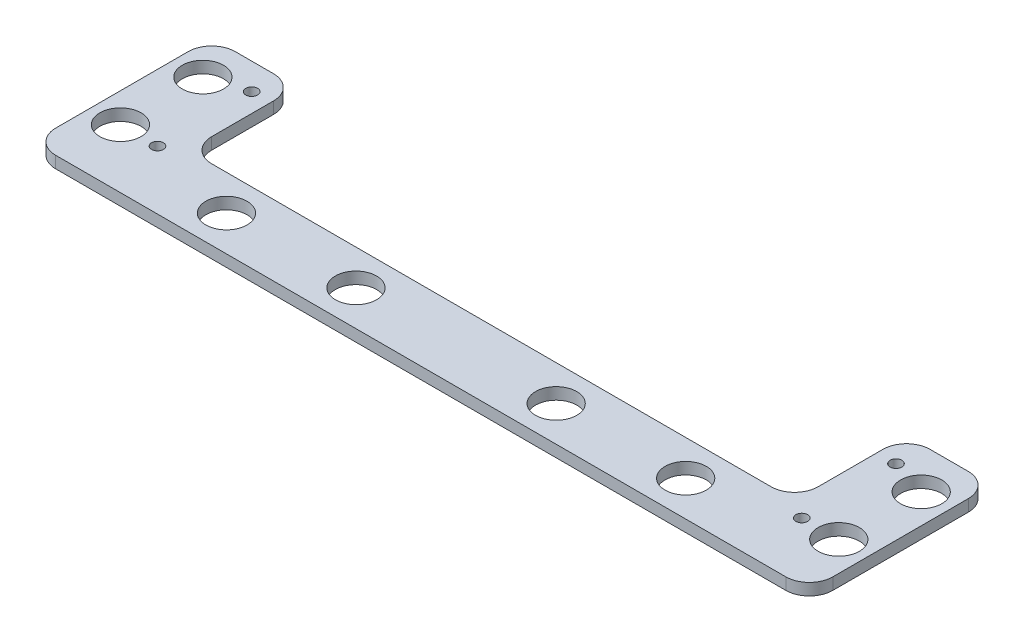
from build123d import *

# Parameters (mm, degrees)
SKETCH1_R          = 44.45
EXTRUDE1_DEPTH     = 12.7
SKETCH2_R          = 12.7
CUT_EXTRUDE1_DEPTH = 897.677561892


with BuildPart() as part:
    # Sketch1 → Extrude1 (new, symmetric)
    with BuildSketch(Plane(origin=(0, 0, 0), x_dir=(1, 0, 0), z_dir=(0, 1, 0))):
        with BuildLine():
            Line((-787.4, -76.2), (787.4, -76.2))
            ThreePointArc((787.4, -76.2), (823.321024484, -61.321024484), (838.2, -25.4))
            Line((838.2, -25.4), (838.2, 266.7))
            ThreePointArc((838.2, 266.7), (823.321024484, 302.621024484), (787.4, 317.5))
            Line((787.4, 317.5), (704.85, 317.5))
            ThreePointArc((704.85, 317.5), (668.928975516, 302.621024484), (654.05, 266.7))
            Line((654.05, 266.7), (654.05, 127))
            ThreePointArc((654.05, 127), (639.171024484, 91.078975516), (603.25, 76.2))
            Line((603.25, 76.2), (-603.25, 76.2))
            ThreePointArc((-603.25, 76.2), (-639.171024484, 91.078975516), (-654.05, 127))
            Line((-654.05, 127), (-654.05, 260.35))
            ThreePointArc((-654.05, 260.35), (-668.928975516, 296.271024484), (-704.85, 311.15))
            Line((-704.85, 311.15), (-787.4, 311.15))
            ThreePointArc((-787.4, 311.15), (-823.321024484, 296.271024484), (-838.2, 260.35))
            Line((-838.2, 260.35), (-838.2, -25.4))
            ThreePointArc((-838.2, -25.4), (-823.321024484, -61.321024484), (-787.4, -76.2))
        make_face()
        with Locations(Location((774.7, 228.6, 0), (0, 0, 270))):
            Circle(SKETCH1_R, mode=Mode.SUBTRACT)
        with Locations(Location((-774.7, 228.6, 0), (0, 0, 90))):
            Circle(SKETCH1_R, mode=Mode.SUBTRACT)
        with Locations(Location((774.7, 50.8, 0), (0, 0, 270))):
            Circle(SKETCH1_R, mode=Mode.SUBTRACT)
        with Locations(Location((-774.7, 50.8, 0), (0, 0, 90))):
            Circle(SKETCH1_R, mode=Mode.SUBTRACT)
        with Locations(Location((495.3, 0, 0), (0, 0, 270))):
            Circle(SKETCH1_R, mode=Mode.SUBTRACT)
        with Locations(Location((-495.3, 0, 0), (0, 0, 90))):
            Circle(SKETCH1_R, mode=Mode.SUBTRACT)
        with Locations(Location((215.9, 0, 0), (0, 0, 270))):
            Circle(SKETCH1_R, mode=Mode.SUBTRACT)
        with Locations(Location((-215.9, 0, 0), (0, 0, 90))):
            Circle(SKETCH1_R, mode=Mode.SUBTRACT)
    extrude(amount=EXTRUDE1_DEPTH, both=True)

    # Sketch2 → Cut-Extrude1 (cut, through all)
    with BuildSketch(Plane(origin=(0, 12.7, 0), x_dir=(-1, 0, 0), z_dir=(0, 1, 0))):
        with Locations(Location((694.863233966, -50.8, 0), (0, 0, 90))):
            Circle(SKETCH2_R)
        with Locations(Location((694.863233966, -254, 0), (0, 0, 90))):
            Circle(SKETCH2_R)
    cut_extrude1 = extrude(amount=-CUT_EXTRUDE1_DEPTH, mode=Mode.SUBTRACT)

    # Mirror1: Cut-Extrude1 across plane
    add(cut_extrude1.mirror(Plane(origin=(0, 0, 0), x_dir=(0, 0, 1), z_dir=(1, 0, 0))), mode=Mode.SUBTRACT)


solid = part.part
